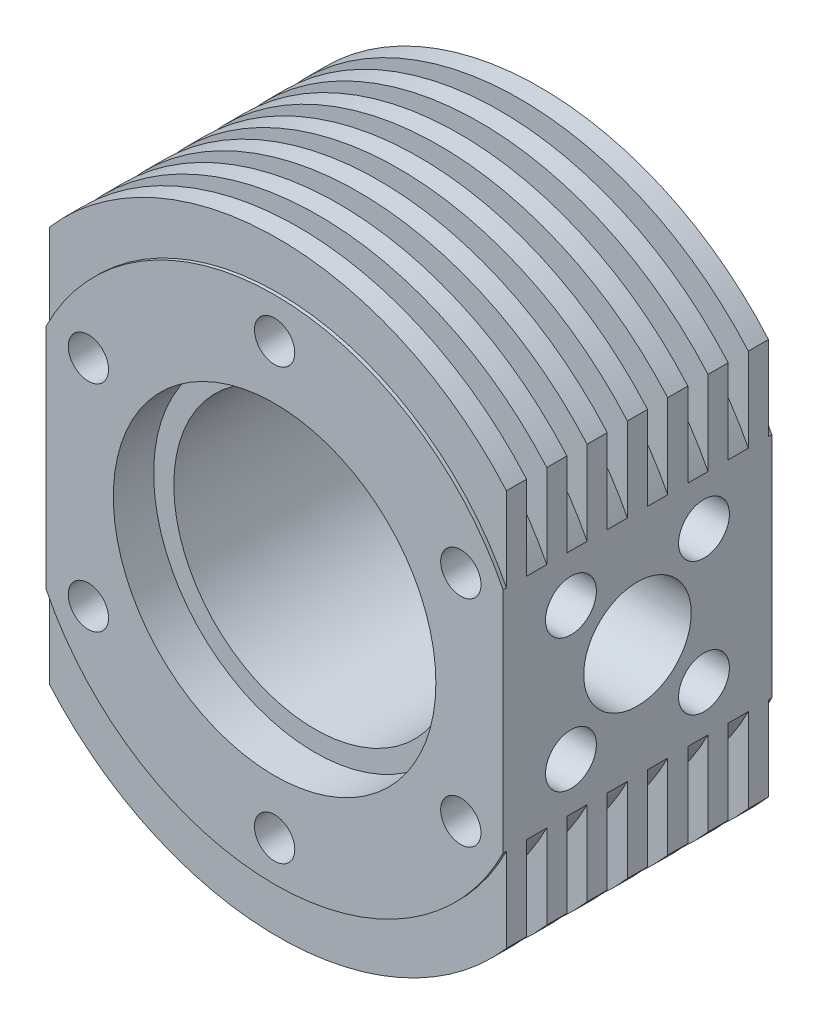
from build123d import *

# Parameters (mm, degrees)
SKETCH1_R               = 10.5
BOSS_EXTRUDE1_DEPTH     = 20
SKETCH2_R               = 12
CUT_EXTRUDE1_DEPTH      = 3
SKETCH4_OUTSIDE_W       = 47.968
SKETCH4_OUTSIDE_H       = 58.968
SKETCH4_OUTSIDE_R       = 19
CUT_EXTRUDE2_DEPTH      = 0.25
SKETCH5_OUTSIDE_W       = 47.968
SKETCH5_OUTSIDE_H       = 58.968
SKETCH5_OUTSIDE_R       = 19
CUT_EXTRUDE3_DEPTH      = 0.25
CUT_EXTRUDE4_START      = -1.5
CUT_EXTRUDE4_DEPTH      = 1.5
LPATTERN1_COUNT         = 6
LPATTERN1_PITCH         = 3
MIRROR1_START           = -1.5
MIRROR1_COPY_1_DEPTH    = 1.5
MIRROR1_COPY_2_DEPTH    = 1.5
MIRROR1_COPY_3_DEPTH    = 1.5
MIRROR1_COPY_4_DEPTH    = 1.5
MIRROR1_COPY_5_DEPTH    = 1.5
CUT_EXTRUDE5_REACH      = 47.412
CUT_EXTRUDE5_END_RADIUS = 10.5
SKETCH9_R               = 4
SKETCH10_R              = 1.892494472
CUT_EXTRUDE6_DEPTH      = 4
SKETCH12_R              = 1.5
CUT_EXTRUDE7_DEPTH      = 4


with BuildPart() as part:
    # Sketch1 → Boss-Extrude1 (new body)
    with BuildSketch(Plane.XY):
        with BuildLine():
            Line((17, -14.739402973), (17, 14.739402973))
            ThreePointArc((17, 14.739402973), (0, 22.5), (-17, 14.739402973))
            Line((-17, 14.739402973), (-17, -14.739402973))
            ThreePointArc((-17, -14.739402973), (0, -22.5), (17, -14.739402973))
        make_face()
        Circle(SKETCH1_R, mode=Mode.SUBTRACT)
    extrude(amount=BOSS_EXTRUDE1_DEPTH)

    # Sketch2 → Cut-Extrude1 (cut)
    with BuildSketch(Plane.XY.offset(20)):
        Circle(SKETCH2_R)
    extrude(amount=-CUT_EXTRUDE1_DEPTH, mode=Mode.SUBTRACT)

    # Sketch4 outside → Cut-Extrude2 (cut)
    with BuildSketch(Plane(origin=(0, 0, 0), x_dir=(-1, 0, 0), z_dir=(0, 0, -1))):
        Rectangle(SKETCH4_OUTSIDE_W, SKETCH4_OUTSIDE_H)
        Circle(SKETCH4_OUTSIDE_R, mode=Mode.SUBTRACT)
    extrude(amount=-CUT_EXTRUDE2_DEPTH, mode=Mode.SUBTRACT)

    # Sketch5 outside → Cut-Extrude3 (cut)
    with BuildSketch(Plane.XY.offset(20)):
        Rectangle(SKETCH5_OUTSIDE_W, SKETCH5_OUTSIDE_H)
        Circle(SKETCH5_OUTSIDE_R, mode=Mode.SUBTRACT)
    extrude(amount=-CUT_EXTRUDE3_DEPTH, mode=Mode.SUBTRACT)

    # Sketch6 → Cut-Extrude4 (cut)
    with BuildSketch(Plane.XY.offset(18.25).offset(CUT_EXTRUDE4_START)):
        with BuildLine():
            Line((17, 8.485281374), (17, 14.739402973))
            ThreePointArc((17, 14.739402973), (0, 22.5), (-17, 14.739402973))
            Line((-17, 14.739402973), (-17, 8.485281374))
            ThreePointArc((-17, 8.485281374), (0, 19), (17, 8.485281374))
        make_face()
    cut_extrude4 = extrude(amount=CUT_EXTRUDE4_DEPTH, mode=Mode.SUBTRACT)

    # LPattern1: Cut-Extrude4 ×6
    with Locations(*[(0, 0, -i * LPATTERN1_PITCH) for i in range(1, LPATTERN1_COUNT)]):
        add(cut_extrude4, mode=Mode.SUBTRACT)

    # Mirror1: Cut-Extrude4 across plane
    add(cut_extrude4.mirror(Plane.ZX), mode=Mode.SUBTRACT)

    # Mirror1 copy 1 sketch → Mirror1 copy 1 (cut)
    with BuildSketch(Plane.XY.offset(15.25).offset(MIRROR1_START)):
        with BuildLine():
            Line((17, -8.485281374), (17, -14.739402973))
            ThreePointArc((17, -14.739402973), (0, -22.5), (-17, -14.739402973))
            Line((-17, -14.739402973), (-17, -8.485281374))
            ThreePointArc((-17, -8.485281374), (0, -19), (17, -8.485281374))
        make_face()
    extrude(amount=MIRROR1_COPY_1_DEPTH, mode=Mode.SUBTRACT)

    # Mirror1 copy 2 sketch → Mirror1 copy 2 (cut)
    with BuildSketch(Plane.XY.offset(12.25).offset(MIRROR1_START)):
        with BuildLine():
            Line((17, -8.485281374), (17, -14.739402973))
            ThreePointArc((17, -14.739402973), (0, -22.5), (-17, -14.739402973))
            Line((-17, -14.739402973), (-17, -8.485281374))
            ThreePointArc((-17, -8.485281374), (0, -19), (17, -8.485281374))
        make_face()
    extrude(amount=MIRROR1_COPY_2_DEPTH, mode=Mode.SUBTRACT)

    # Mirror1 copy 3 sketch → Mirror1 copy 3 (cut)
    with BuildSketch(Plane.XY.offset(9.25).offset(MIRROR1_START)):
        with BuildLine():
            Line((17, -8.485281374), (17, -14.739402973))
            ThreePointArc((17, -14.739402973), (0, -22.5), (-17, -14.739402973))
            Line((-17, -14.739402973), (-17, -8.485281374))
            ThreePointArc((-17, -8.485281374), (0, -19), (17, -8.485281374))
        make_face()
    extrude(amount=MIRROR1_COPY_3_DEPTH, mode=Mode.SUBTRACT)

    # Mirror1 copy 4 sketch → Mirror1 copy 4 (cut)
    with BuildSketch(Plane.XY.offset(6.25).offset(MIRROR1_START)):
        with BuildLine():
            Line((17, -8.485281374), (17, -14.739402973))
            ThreePointArc((17, -14.739402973), (0, -22.5), (-17, -14.739402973))
            Line((-17, -14.739402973), (-17, -8.485281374))
            ThreePointArc((-17, -8.485281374), (0, -19), (17, -8.485281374))
        make_face()
    extrude(amount=MIRROR1_COPY_4_DEPTH, mode=Mode.SUBTRACT)

    # Mirror1 copy 5 sketch → Mirror1 copy 5 (cut)
    with BuildSketch(Plane.XY.offset(3.25).offset(MIRROR1_START)):
        with BuildLine():
            Line((17, -8.485281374), (17, -14.739402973))
            ThreePointArc((17, -14.739402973), (0, -22.5), (-17, -14.739402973))
            Line((-17, -14.739402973), (-17, -8.485281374))
            ThreePointArc((-17, -8.485281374), (0, -19), (17, -8.485281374))
        make_face()
    extrude(amount=MIRROR1_COPY_5_DEPTH, mode=Mode.SUBTRACT)

    # Cut-Extrude5: up to this cylinder (the profile starts outside it)
    cut_extrude5_end = Plane(origin=(0, 0, 10), z_dir=(0, 0, -1)) * Cylinder(CUT_EXTRUDE5_END_RADIUS, 116.824, mode=Mode.PRIVATE)
    # Sketch9 → Cut-Extrude5 (cut, up to the surface)
    with BuildSketch(Plane(origin=(17, 0, 0), x_dir=(0, 0, -1), z_dir=(1, 0, 0)), mode=Mode.PRIVATE) as cut_extrude5_sk1:
        with Locations((-10, 0)):
            Circle(SKETCH9_R)
    cut_extrude5_tool1 = extrude(cut_extrude5_sk1.sketch, amount=-CUT_EXTRUDE5_REACH, mode=Mode.PRIVATE) - cut_extrude5_end
    add(cut_extrude5_tool1.solids().sort_by_distance((17, 0, 10))[0], mode=Mode.SUBTRACT)

    # Sketch10 → Cut-Extrude6 (cut)
    with BuildSketch(Plane(origin=(17, 0, 0), x_dir=(0, 0, -1), z_dir=(1, 0, 0))):
        with Locations((-5.050252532, 4.949747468)):
            Circle(SKETCH10_R)
        with Locations(Location((-5.050252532, -4.949747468, 0), (0, 0, 180))):
            Circle(SKETCH10_R)
        with Locations((-14.949747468, -4.949747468)):
            Circle(SKETCH10_R)
        with Locations(Location((-14.949747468, 4.949747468, 0), (0, 0, 180))):
            Circle(SKETCH10_R)
    cut_extrude6 = extrude(amount=-CUT_EXTRUDE6_DEPTH, mode=Mode.SUBTRACT)

    # Sketch11 → Cut-Revolve1 (revolve, cut)
    with BuildSketch(Plane.XY.offset(10), mode=Mode.PRIVATE) as cut_revolve1_sk:
        Polygon((-17, 0), (-11.5, 0), (-14.5, -3), (-17, -3), align=None)
    revolve(cut_revolve1_sk.sketch.rotate(Axis((-17, 0, 10), (1, 0, 0)), 270), axis=Axis((-17, 0, 10), (1, 0, 0)), mode=Mode.SUBTRACT)

    # Mirror2: Cut-Extrude6 across plane
    add(cut_extrude6.mirror(Plane(origin=(0, 0, 0), x_dir=(0, 0, 1), z_dir=(1, 0, 0))), mode=Mode.SUBTRACT)

    # Sketch12 → Cut-Extrude7 (cut)
    with BuildSketch(Plane.XY.offset(20)):
        with Locations((0, 16)):
            Circle(SKETCH12_R)
        with Locations((13.856406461, 8)):
            Circle(SKETCH12_R)
        with Locations((13.856406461, -8)):
            Circle(SKETCH12_R)
        with Locations((0, -16)):
            Circle(SKETCH12_R)
        with Locations((-13.856406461, -8)):
            Circle(SKETCH12_R)
        with Locations((-13.856406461, 8)):
            Circle(SKETCH12_R)
    cut_extrude7 = extrude(amount=-CUT_EXTRUDE7_DEPTH, mode=Mode.SUBTRACT)

    # Mirror3: Cut-Extrude7 across plane
    add(cut_extrude7.mirror(Plane.XY.offset(10)), mode=Mode.SUBTRACT)


solid = part.part
